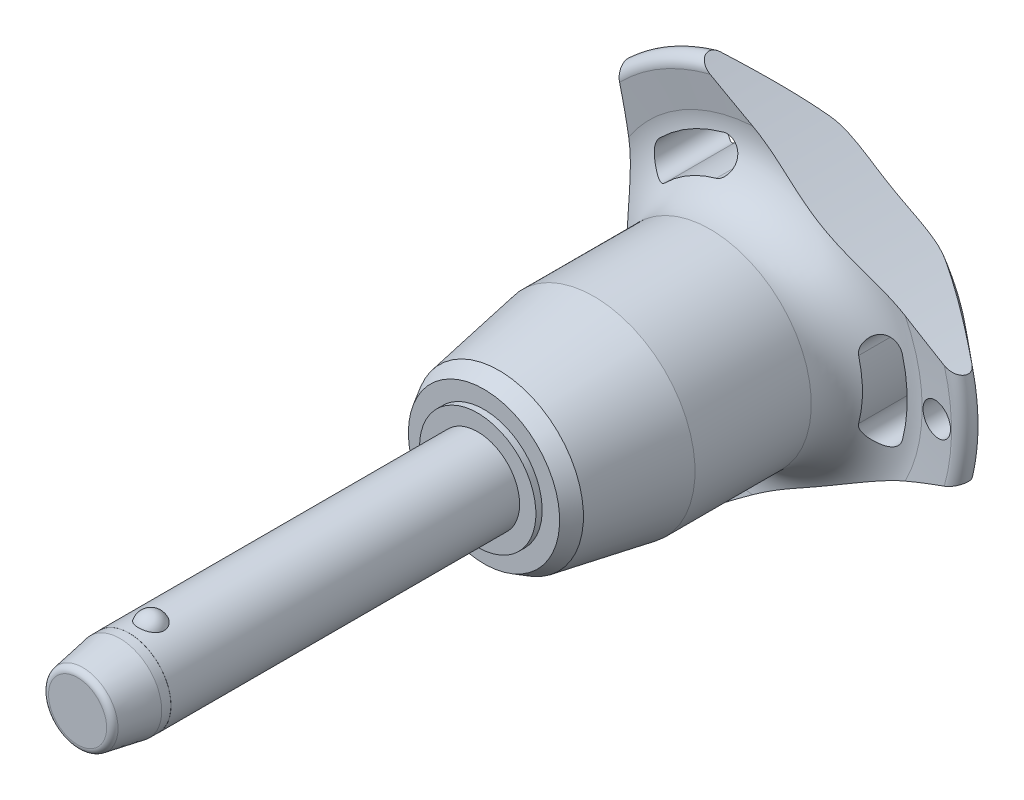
from build123d import *

# Parameters (mm, degrees)
SKETCH1_R           = 4
BOSS_EXTRUDE1_DEPTH = 30
SKETCH2_R           = 3.4
BOSS_EXTRUDE2_DEPTH = 33.3
BOSS_EXTRUDE3_START = 8.2
SKETCH1_2_R         = 4
BOSS_EXTRUDE3_DEPTH = 8.2
CHAMFER1_SIZE       = 4.1
CHAMFER1_SIZE2      = 0.722940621
FILLET1_R           = 0.6
SKETCH6_R           = 102.8
CUT_EXTRUDE1_DEPTH  = 70.10619492
CIRPATTERN1_COUNT   = 3
SKETCH7_R           = 1.5
CUT_EXTRUDE2_DEPTH  = 69.871754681
SKETCH8_R           = 4
SKETCH8_R_2         = 3.99
CUT_EXTRUDE3_DEPTH  = 4.92


with BuildPart() as part:
    # Sketch1 → Boss-Extrude1 (new body)
    with BuildSketch(Plane.XY):
        Circle(SKETCH1_R)
    extrude(amount=-BOSS_EXTRUDE1_DEPTH)

    # Sketch2 → Boss-Extrude2 (add)
    with BuildSketch(Plane(origin=(0, 0, -30), x_dir=(-1, 0, 0), z_dir=(0, 0, -1))):
        Circle(SKETCH2_R)
    extrude(amount=BOSS_EXTRUDE2_DEPTH)

    # Sketch3 → Revolve1 (revolve)
    with BuildSketch(Plane(origin=(0, 0, 0), x_dir=(0, 0, -1), z_dir=(1, 0, 0))):
        with BuildLine():
            Line((-1.2, 4.8), (-1.2, 2.2))
            ThreePointArc((-1.2, 2.2), (0.1, 3.5), (-1.2, 4.8))
        make_face()
        with BuildLine():
            Line((-1.2, -2.2), (-1.2, -4.8))
            ThreePointArc((-1.2, -4.8), (0.1, -3.5), (-1.2, -2.2))
        make_face()
    revolve(axis=Axis((0, -2.2, 1.2), (0, 1, 0)))

    # Sketch1_2 → Boss-Extrude3 (add)
    with BuildSketch(Plane.XY.offset(BOSS_EXTRUDE3_START)):
        Circle(SKETCH1_2_R)
    extrude(amount=-BOSS_EXTRUDE3_DEPTH)

    # Chamfer1
    chamfer1_edges = [part.edges().sort_by_distance(p)[0] for p in [
        (-4, 0, 8.2),
    ]]
    chamfer1_side = [part.faces().sort_by_distance(p)[0] for p in [
        (-4, 0, -10.9),
    ]]
    chamfer(chamfer1_edges, length=CHAMFER1_SIZE, length2=CHAMFER1_SIZE2, reference=chamfer1_side[0])

    # Fillet1
    fillet1_edges = [part.edges().sort_by_distance(p)[0] for p in [
        (-3.277059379, 0, 8.2),
        (3.4, 0, -63.3),
    ]]
    fillet(fillet1_edges, radius=FILLET1_R)

    # Sketch4 → Revolve2 (revolve)
    with BuildSketch(Plane(origin=(0, 0, 0), x_dir=(0, 0, -1), z_dir=(1, 0, 0)), mode=Mode.PRIVATE) as revolve2_sk:
        Polygon((30, 0), (30, 5.554101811), (30.6, 5.554101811), (30.6, 7.220004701), (32.042714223, 8.052956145), (41.1, 9.65), (52.2, 9.65), (52.2, 0), align=None)
    revolve(revolve2_sk.sketch.rotate(Axis((0, 0, -52.2), (0, 0, 1)), 90), axis=Axis((0, 0, -52.2), (0, 0, 1)))

    # Sketch5 → Revolve3 (revolve)
    with BuildSketch(Plane(origin=(0, 0, 0), x_dir=(0, 0, -1), z_dir=(1, 0, 0)), mode=Mode.PRIVATE) as revolve3_sk:
        with BuildLine():
            Line((57.16082631, 15.274661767), (56.757834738, 18.475067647))
            ThreePointArc((56.757834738, 18.475067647), (57.349836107, 19.516443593), (58.516044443, 19.24278761))
            Line((58.516044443, 19.24278761), (62.835691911, 14.094832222))
            ThreePointArc((62.835691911, 14.094832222), (63.3, 12.689260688), (62.67067517, 11.349423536))
            ThreePointArc((62.67067517, 11.349423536), (59.033110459, 6.185112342), (57.75, 0))
            Line((57.75, 0), (52.2, 0))
            Line((52.2, 0), (52.2, 9.65))
            ThreePointArc((52.2, 9.65), (55.949887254, 11.342683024), (57.16082631, 15.274661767))
        make_face()
    revolve(revolve3_sk.sketch.rotate(Axis((0, 0, -57.75), (0, 0, 1)), 90), axis=Axis((0, 0, -57.75), (0, 0, 1)))

    # Sketch6 → Cut-Extrude1 (cut, through all)
    with BuildSketch(Plane.XY):
        with Locations((-115.2, 0)):
            Circle(SKETCH6_R)
        with BuildLine():
            ThreePointArc((13.411913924, -3.529271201), (13.868496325, 0), (13.411913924, 3.529271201))
            ThreePointArc((13.411913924, 3.529271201), (11.694200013, 4.531299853), (10.692171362, 2.813585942))
            ThreePointArc((10.692171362, 2.813585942), (11.056165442, 0), (10.692171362, -2.813585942))
            ThreePointArc((10.692171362, -2.813585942), (11.694200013, -4.531299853), (13.411913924, -3.529271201))
        make_face()
    cut_extrude1 = extrude(amount=-CUT_EXTRUDE1_DEPTH, mode=Mode.SUBTRACT)

    # CirPattern1: Cut-Extrude1 ×3 about axis
    cirpattern1_axis = Axis((0, 0, 0), (0, 0, 1))
    for i in range(1, CIRPATTERN1_COUNT):
        add(cut_extrude1.rotate(cirpattern1_axis, i * 360 / CIRPATTERN1_COUNT), mode=Mode.SUBTRACT)

    # Sketch7 → Cut-Extrude2 (cut, through all)
    with BuildSketch(Plane.XY):
        with Locations(Location((16.868496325, 0, 0), (0, 0, 225.467095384))):
            Circle(SKETCH7_R)
    extrude(amount=-CUT_EXTRUDE2_DEPTH, mode=Mode.SUBTRACT)

    # Sketch8 → Cut-Extrude3 (cut)
    with BuildSketch(Plane.XY.offset(8.2)):
        Circle(SKETCH8_R)
        Circle(SKETCH8_R_2, mode=Mode.SUBTRACT)
    extrude(amount=-CUT_EXTRUDE3_DEPTH, mode=Mode.SUBTRACT)


solid = part.part
